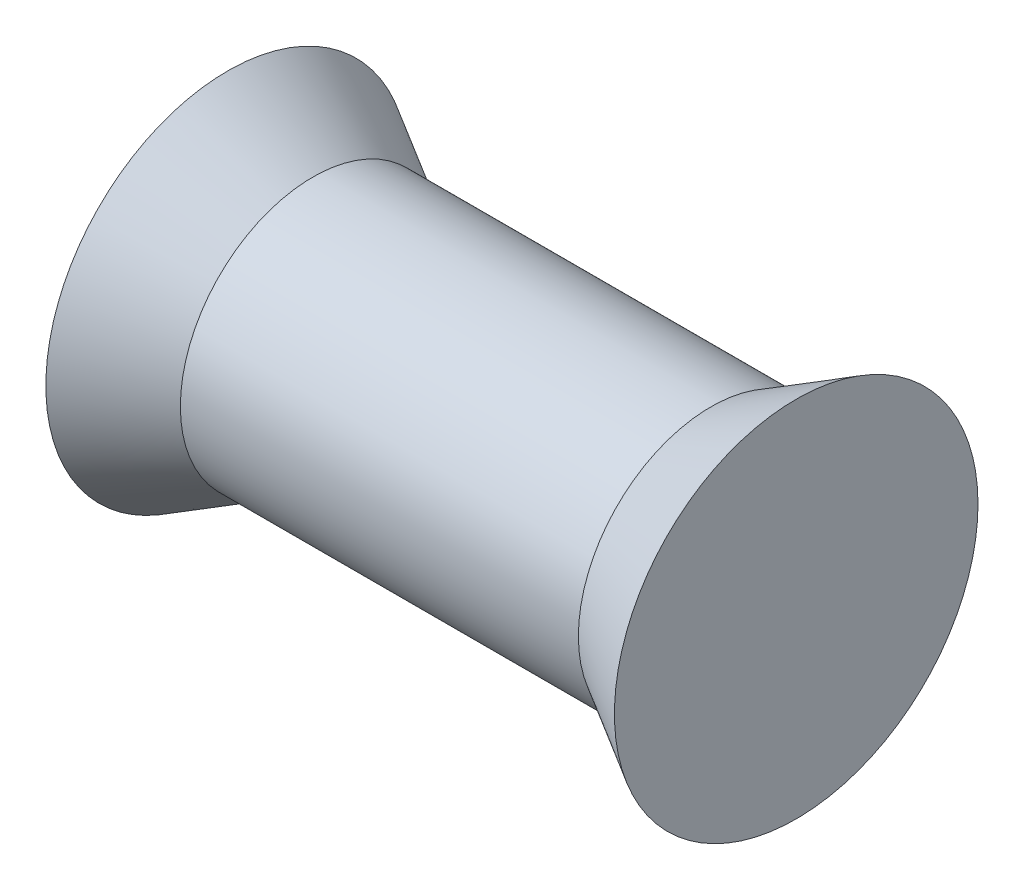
from build123d import *


with BuildPart() as part:
    # Sketch 1 → Revolve 1 (revolve)
    with BuildSketch(Plane.XY, mode=Mode.PRIVATE) as revolve_1_sk:
        Polygon((0, 0), (0, 3.24843181), (-1.524, 2.36855), (-8.636, 2.36855), (-10.16, 3.24843181), (-10.16, 0), align=None)
    revolve(revolve_1_sk.sketch.rotate(Axis((0, 0, 0), (-1, 0, 0)), 90), axis=Axis((0, 0, 0), (-1, 0, 0)))


solid = part.part
